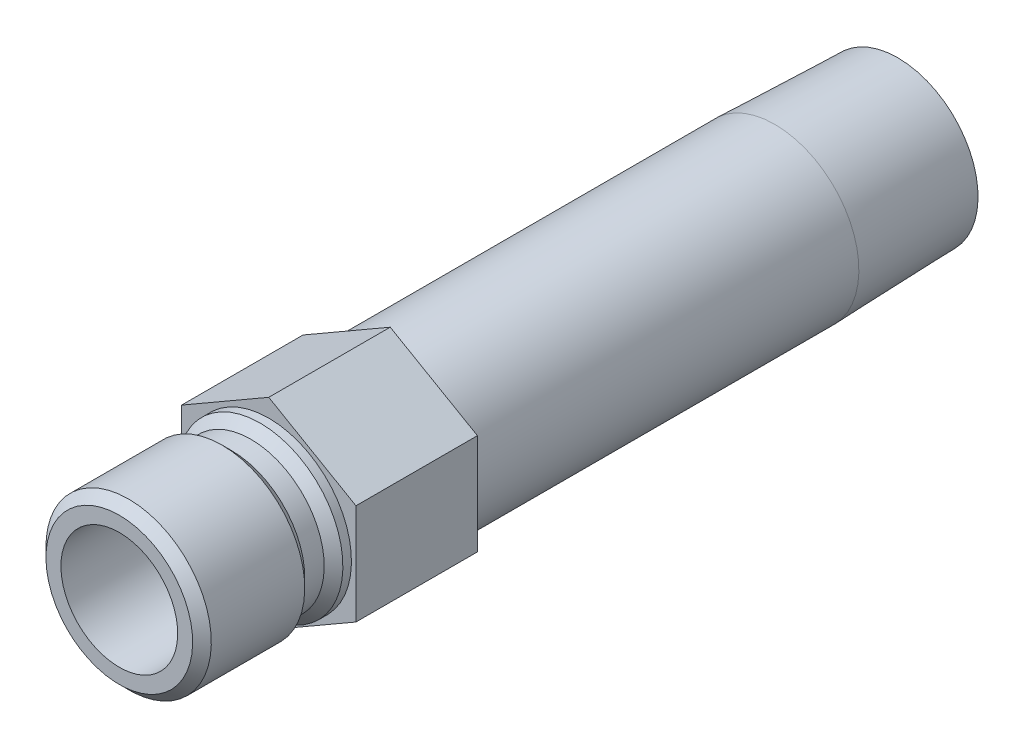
ISO-10303-21;
HEADER;
FILE_DESCRIPTION(('STEP AP214'),'2;1');
FILE_NAME('part.step','',(''),(''),'','','');
FILE_SCHEMA(('AUTOMOTIVE_DESIGN { 1 0 10303 214 1 1 1 1 }'));
ENDSEC;
DATA;
#1=APPLICATION_CONTEXT('core data for automotive mechanical design processes');
#2=APPLICATION_PROTOCOL_DEFINITION('international standard','automotive_design',2000,#1);
#3=PRODUCT_CONTEXT('',#1,'mechanical');
#4=PRODUCT('Part','Part','',(#3));
#5=PRODUCT_RELATED_PRODUCT_CATEGORY('part','',(#4));
#6=PRODUCT_DEFINITION_FORMATION('','',#4);
#7=PRODUCT_DEFINITION_CONTEXT('part definition',#1,'design');
#8=PRODUCT_DEFINITION('design','',#6,#7);
#9=PRODUCT_DEFINITION_SHAPE('','',#8);
#10=(LENGTH_UNIT() NAMED_UNIT(*) SI_UNIT(.MILLI.,.METRE.));
#11=(NAMED_UNIT(*) PLANE_ANGLE_UNIT() SI_UNIT($,.RADIAN.));
#12=(NAMED_UNIT(*) SI_UNIT($,.STERADIAN.) SOLID_ANGLE_UNIT());
#13=UNCERTAINTY_MEASURE_WITH_UNIT(LENGTH_MEASURE(1.E-05),#10,'distance_accuracy_value','');
#14=(GEOMETRIC_REPRESENTATION_CONTEXT(3) GLOBAL_UNCERTAINTY_ASSIGNED_CONTEXT((#13)) GLOBAL_UNIT_ASSIGNED_CONTEXT((#10,
#11,#12)) REPRESENTATION_CONTEXT('',''));
#15=CARTESIAN_POINT('',(0.,0.,0.));
#16=DIRECTION('',(0.,0.,1.));
#17=DIRECTION('',(1.,0.,0.));
#18=AXIS2_PLACEMENT_3D('',#15,#16,#17);
#19=CARTESIAN_POINT('',(0.,0.,0.));
#20=DIRECTION('',(0.,0.,-1.));
#21=DIRECTION('',(0.,1.,0.));
#22=AXIS2_PLACEMENT_3D('',#19,#20,#21);
#23=CYLINDRICAL_SURFACE('',#22,4.7625);
#24=CARTESIAN_POINT('',(0.,0.,0.));
#25=DIRECTION('',(0.,0.,1.));
#26=DIRECTION('',(1.,0.,0.));
#27=AXIS2_PLACEMENT_3D('',#24,#25,#26);
#28=CIRCLE('',#27,4.7625);
#29=CARTESIAN_POINT('',(4.7625,0.,0.));
#30=VERTEX_POINT('',#29);
#31=EDGE_CURVE('E138',#30,#30,#28,.T.);
#32=ORIENTED_EDGE('',*,*,#31,.F.);
#33=EDGE_LOOP('',(#32));
#34=FACE_BOUND('',#33,.T.);
#35=CARTESIAN_POINT('',(0.,0.,12.192));
#36=DIRECTION('',(0.,0.,-1.));
#37=DIRECTION('',(0.,1.,0.));
#38=AXIS2_PLACEMENT_3D('',#35,#36,#37);
#39=CIRCLE('',#38,4.7625);
#40=CARTESIAN_POINT('',(0.,4.7625,12.192));
#41=VERTEX_POINT('',#40);
#42=EDGE_CURVE('E11',#41,#41,#39,.T.);
#43=ORIENTED_EDGE('',*,*,#42,.F.);
#44=EDGE_LOOP('',(#43));
#45=FACE_BOUND('',#44,.T.);
#46=ADVANCED_FACE('F33',(#34,#45),#23,.F.);
#47=CARTESIAN_POINT('',(0.,4.7625,12.192));
#48=DIRECTION('',(0.,0.,1.));
#49=DIRECTION('',(0.,-1.,0.));
#50=AXIS2_PLACEMENT_3D('',#47,#48,#49);
#51=PLANE('',#50);
#52=ORIENTED_EDGE('',*,*,#42,.T.);
#53=EDGE_LOOP('',(#52));
#54=FACE_BOUND('',#53,.T.);
#55=CARTESIAN_POINT('',(0.,0.,12.192));
#56=DIRECTION('',(0.,0.,-1.));
#57=DIRECTION('',(0.,1.,0.));
#58=AXIS2_PLACEMENT_3D('',#55,#56,#57);
#59=CIRCLE('',#58,5.9817);
#60=CARTESIAN_POINT('',(0.,5.9817,12.192));
#61=VERTEX_POINT('',#60);
#62=EDGE_CURVE('E41',#61,#61,#59,.T.);
#63=ORIENTED_EDGE('',*,*,#62,.F.);
#64=EDGE_LOOP('',(#63));
#65=FACE_BOUND('',#64,.T.);
#66=ADVANCED_FACE('F181',(#54,#65),#51,.T.);
#67=CARTESIAN_POINT('',(0.,0.,11.43));
#68=DIRECTION('',(0.,0.,-1.));
#69=DIRECTION('',(0.,1.,0.));
#70=AXIS2_PLACEMENT_3D('',#67,#68,#69);
#71=CONICAL_SURFACE('',#70,6.7437,0.785398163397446);
#72=ORIENTED_EDGE('',*,*,#62,.T.);
#73=EDGE_LOOP('',(#72));
#74=FACE_BOUND('',#73,.T.);
#75=CARTESIAN_POINT('',(0.,0.,11.43));
#76=DIRECTION('',(0.,0.,-1.));
#77=DIRECTION('',(0.,1.,0.));
#78=AXIS2_PLACEMENT_3D('',#75,#76,#77);
#79=CIRCLE('',#78,6.7437);
#80=CARTESIAN_POINT('',(0.,6.7437,11.43));
#81=VERTEX_POINT('',#80);
#82=EDGE_CURVE('E173',#81,#81,#79,.T.);
#83=ORIENTED_EDGE('',*,*,#82,.F.);
#84=EDGE_LOOP('',(#83));
#85=FACE_BOUND('',#84,.T.);
#86=ADVANCED_FACE('F178',(#74,#85),#71,.T.);
#87=CARTESIAN_POINT('',(0.,0.,0.));
#88=DIRECTION('',(0.,0.,-1.));
#89=DIRECTION('',(0.,1.,0.));
#90=AXIS2_PLACEMENT_3D('',#87,#88,#89);
#91=CYLINDRICAL_SURFACE('',#90,6.7437);
#92=ORIENTED_EDGE('',*,*,#82,.T.);
#93=EDGE_LOOP('',(#92));
#94=FACE_BOUND('',#93,.T.);
#95=CARTESIAN_POINT('',(0.,0.,3.81));
#96=DIRECTION('',(0.,0.,-1.));
#97=DIRECTION('',(0.,1.,0.));
#98=AXIS2_PLACEMENT_3D('',#95,#96,#97);
#99=CIRCLE('',#98,6.7437);
#100=CARTESIAN_POINT('',(0.,6.7437,3.81));
#101=VERTEX_POINT('',#100);
#102=EDGE_CURVE('E170',#101,#101,#99,.T.);
#103=ORIENTED_EDGE('',*,*,#102,.F.);
#104=EDGE_LOOP('',(#103));
#105=FACE_BOUND('',#104,.T.);
#106=ADVANCED_FACE('F188',(#94,#105),#91,.T.);
#107=CARTESIAN_POINT('',(0.,0.,3.048));
#108=DIRECTION('',(0.,0.,1.));
#109=DIRECTION('',(0.,-1.,0.));
#110=AXIS2_PLACEMENT_3D('',#107,#108,#109);
#111=CONICAL_SURFACE('',#110,5.9817,0.785398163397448);
#112=ORIENTED_EDGE('',*,*,#102,.T.);
#113=EDGE_LOOP('',(#112));
#114=FACE_BOUND('',#113,.T.);
#115=CARTESIAN_POINT('',(0.,0.,3.048));
#116=DIRECTION('',(0.,0.,-1.));
#117=DIRECTION('',(0.,1.,0.));
#118=AXIS2_PLACEMENT_3D('',#115,#116,#117);
#119=CIRCLE('',#118,5.9817);
#120=CARTESIAN_POINT('',(0.,5.9817,3.048));
#121=VERTEX_POINT('',#120);
#122=EDGE_CURVE('E167',#121,#121,#119,.T.);
#123=ORIENTED_EDGE('',*,*,#122,.F.);
#124=EDGE_LOOP('',(#123));
#125=FACE_BOUND('',#124,.T.);
#126=ADVANCED_FACE('F194',(#114,#125),#111,.T.);
#127=CARTESIAN_POINT('',(0.,0.,0.));
#128=DIRECTION('',(0.,0.,-1.));
#129=DIRECTION('',(0.,1.,0.));
#130=AXIS2_PLACEMENT_3D('',#127,#128,#129);
#131=CYLINDRICAL_SURFACE('',#130,5.9817);
#132=ORIENTED_EDGE('',*,*,#122,.T.);
#133=EDGE_LOOP('',(#132));
#134=FACE_BOUND('',#133,.T.);
#135=CARTESIAN_POINT('',(0.,0.,1.4605));
#136=DIRECTION('',(0.,0.,-1.));
#137=DIRECTION('',(0.,1.,0.));
#138=AXIS2_PLACEMENT_3D('',#135,#136,#137);
#139=CIRCLE('',#138,5.9817);
#140=CARTESIAN_POINT('',(0.,5.9817,1.4605));
#141=VERTEX_POINT('',#140);
#142=EDGE_CURVE('E164',#141,#141,#139,.T.);
#143=ORIENTED_EDGE('',*,*,#142,.F.);
#144=EDGE_LOOP('',(#143));
#145=FACE_BOUND('',#144,.T.);
#146=ADVANCED_FACE('F198',(#134,#145),#131,.T.);
#147=CARTESIAN_POINT('',(0.,0.,0.698499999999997));
#148=DIRECTION('',(0.,0.,-1.));
#149=DIRECTION('',(0.,1.,0.));
#150=AXIS2_PLACEMENT_3D('',#147,#148,#149);
#151=CONICAL_SURFACE('',#150,6.7437,0.785398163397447);
#152=ORIENTED_EDGE('',*,*,#142,.T.);
#153=EDGE_LOOP('',(#152));
#154=FACE_BOUND('',#153,.T.);
#155=CARTESIAN_POINT('',(0.,0.,0.698499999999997));
#156=DIRECTION('',(0.,0.,-1.));
#157=DIRECTION('',(0.,1.,0.));
#158=AXIS2_PLACEMENT_3D('',#155,#156,#157);
#159=CIRCLE('',#158,6.7437);
#160=CARTESIAN_POINT('',(0.,6.7437,0.698499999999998));
#161=VERTEX_POINT('',#160);
#162=EDGE_CURVE('E161',#161,#161,#159,.T.);
#163=ORIENTED_EDGE('',*,*,#162,.F.);
#164=EDGE_LOOP('',(#163));
#165=FACE_BOUND('',#164,.T.);
#166=ADVANCED_FACE('F202',(#154,#165),#151,.T.);
#167=CARTESIAN_POINT('',(0.,0.,0.));
#168=DIRECTION('',(0.,0.,-1.));
#169=DIRECTION('',(0.,1.,0.));
#170=AXIS2_PLACEMENT_3D('',#167,#168,#169);
#171=CYLINDRICAL_SURFACE('',#170,6.7437);
#172=ORIENTED_EDGE('',*,*,#162,.T.);
#173=EDGE_LOOP('',(#172));
#174=FACE_BOUND('',#173,.T.);
#175=CARTESIAN_POINT('',(0.,0.,0.));
#176=DIRECTION('',(0.,0.,-1.));
#177=DIRECTION('',(0.,1.,0.));
#178=AXIS2_PLACEMENT_3D('',#175,#176,#177);
#179=CIRCLE('',#178,6.7437);
#180=CARTESIAN_POINT('',(0.,6.7437,0.));
#181=VERTEX_POINT('',#180);
#182=EDGE_CURVE('E158',#181,#181,#179,.T.);
#183=ORIENTED_EDGE('',*,*,#182,.F.);
#184=EDGE_LOOP('',(#183));
#185=FACE_BOUND('',#184,.T.);
#186=ADVANCED_FACE('F206',(#174,#185),#171,.T.);
#187=CARTESIAN_POINT('',(0.,6.7437,0.));
#188=DIRECTION('',(0.,0.,1.));
#189=DIRECTION('',(0.,-1.,0.));
#190=AXIS2_PLACEMENT_3D('',#187,#188,#189);
#191=PLANE('',#190);
#192=ORIENTED_EDGE('',*,*,#182,.T.);
#193=EDGE_LOOP('',(#192));
#194=FACE_BOUND('',#193,.T.);
#195=DIRECTION('',(-0.866025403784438,-0.5,0.));
#196=VECTOR('',#195,1.);
#197=CARTESIAN_POINT('',(0.,8.21223022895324,0.));
#198=LINE('',#197,#196);
#199=CARTESIAN_POINT('',(0.,8.21223022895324,0.));
#200=VERTEX_POINT('',#199);
#201=CARTESIAN_POINT('',(-7.112,4.10611511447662,0.));
#202=VERTEX_POINT('',#201);
#203=EDGE_CURVE('E120',#200,#202,#198,.T.);
#204=ORIENTED_EDGE('',*,*,#203,.T.);
#205=DIRECTION('',(0.,-1.,0.));
#206=VECTOR('',#205,1.);
#207=CARTESIAN_POINT('',(-7.112,4.10611511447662,0.));
#208=LINE('',#207,#206);
#209=CARTESIAN_POINT('',(-7.112,-4.10611511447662,0.));
#210=VERTEX_POINT('',#209);
#211=EDGE_CURVE('E123',#202,#210,#208,.T.);
#212=ORIENTED_EDGE('',*,*,#211,.T.);
#213=DIRECTION('',(0.866025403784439,-0.5,0.));
#214=VECTOR('',#213,1.);
#215=CARTESIAN_POINT('',(-7.112,-4.10611511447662,0.));
#216=LINE('',#215,#214);
#217=CARTESIAN_POINT('',(0.,-8.21223022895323,0.));
#218=VERTEX_POINT('',#217);
#219=EDGE_CURVE('E127',#210,#218,#216,.T.);
#220=ORIENTED_EDGE('',*,*,#219,.T.);
#221=DIRECTION('',(0.866025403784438,0.5,0.));
#222=VECTOR('',#221,1.);
#223=CARTESIAN_POINT('',(0.,-8.21223022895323,0.));
#224=LINE('',#223,#222);
#225=CARTESIAN_POINT('',(7.112,-4.10611511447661,0.));
#226=VERTEX_POINT('',#225);
#227=EDGE_CURVE('E130',#218,#226,#224,.T.);
#228=ORIENTED_EDGE('',*,*,#227,.T.);
#229=DIRECTION('',(0.,1.,0.));
#230=VECTOR('',#229,1.);
#231=CARTESIAN_POINT('',(7.112,-4.10611511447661,0.));
#232=LINE('',#231,#230);
#233=CARTESIAN_POINT('',(7.112,4.10611511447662,0.));
#234=VERTEX_POINT('',#233);
#235=EDGE_CURVE('E97',#226,#234,#232,.T.);
#236=ORIENTED_EDGE('',*,*,#235,.T.);
#237=DIRECTION('',(-0.866025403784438,0.5,0.));
#238=VECTOR('',#237,1.);
#239=CARTESIAN_POINT('',(7.112,4.10611511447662,0.));
#240=LINE('',#239,#238);
#241=EDGE_CURVE('E133',#234,#200,#240,.T.);
#242=ORIENTED_EDGE('',*,*,#241,.T.);
#243=EDGE_LOOP('',(#204,#212,#220,#228,#236,#242));
#244=FACE_BOUND('',#243,.T.);
#245=ADVANCED_FACE('F210',(#194,#244),#191,.T.);
#246=CARTESIAN_POINT('',(-7.112,4.10611511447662,0.));
#247=DIRECTION('',(0.,0.,1.));
#248=DIRECTION('',(1.,0.,0.));
#249=AXIS2_PLACEMENT_3D('',#246,#247,#248);
#250=PLANE('',#249);
#251=ORIENTED_EDGE('',*,*,#31,.T.);
#252=EDGE_LOOP('',(#251));
#253=FACE_BOUND('',#252,.T.);
#254=CARTESIAN_POINT('',(0.,0.,0.));
#255=DIRECTION('',(0.,0.,1.));
#256=DIRECTION('',(1.,0.,0.));
#257=AXIS2_PLACEMENT_3D('',#254,#255,#256);
#258=CIRCLE('',#257,4.62279999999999);
#259=CARTESIAN_POINT('',(4.62279999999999,0.,0.));
#260=VERTEX_POINT('',#259);
#261=EDGE_CURVE('E124',#260,#260,#258,.T.);
#262=ORIENTED_EDGE('',*,*,#261,.F.);
#263=EDGE_LOOP('',(#262));
#264=FACE_BOUND('',#263,.T.);
#265=ADVANCED_FACE('F214',(#253,#264),#250,.T.);
#266=CARTESIAN_POINT('',(0.,0.,-51.308));
#267=DIRECTION('',(0.,0.,1.));
#268=DIRECTION('',(0.,-1.,0.));
#269=AXIS2_PLACEMENT_3D('',#266,#267,#268);
#270=CONICAL_SURFACE('',#269,6.54447060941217,0.0312396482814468);
#271=CARTESIAN_POINT('',(0.,0.,-41.275));
#272=DIRECTION('',(0.,0.,-1.));
#273=DIRECTION('',(0.,1.,0.));
#274=AXIS2_PLACEMENT_3D('',#271,#272,#273);
#275=CIRCLE('',#274,6.85799999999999);
#276=CARTESIAN_POINT('',(0.,6.858,-41.275));
#277=VERTEX_POINT('',#276);
#278=EDGE_CURVE('E155',#277,#277,#275,.T.);
#279=ORIENTED_EDGE('',*,*,#278,.T.);
#280=EDGE_LOOP('',(#279));
#281=FACE_BOUND('',#280,.T.);
#282=CARTESIAN_POINT('',(0.,0.,-51.308));
#283=DIRECTION('',(0.,0.,-1.));
#284=DIRECTION('',(0.,1.,0.));
#285=AXIS2_PLACEMENT_3D('',#282,#283,#284);
#286=CIRCLE('',#285,6.54447060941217);
#287=CARTESIAN_POINT('',(0.,6.54447060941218,-51.308));
#288=VERTEX_POINT('',#287);
#289=EDGE_CURVE('E152',#288,#288,#286,.T.);
#290=ORIENTED_EDGE('',*,*,#289,.F.);
#291=EDGE_LOOP('',(#290));
#292=FACE_BOUND('',#291,.T.);
#293=ADVANCED_FACE('F220',(#281,#292),#270,.T.);
#294=CARTESIAN_POINT('',(0.,0.,0.));
#295=DIRECTION('',(0.,0.,-1.));
#296=DIRECTION('',(0.,1.,0.));
#297=AXIS2_PLACEMENT_3D('',#294,#295,#296);
#298=CYLINDRICAL_SURFACE('',#297,6.858);
#299=ORIENTED_EDGE('',*,*,#278,.F.);
#300=EDGE_LOOP('',(#299));
#301=FACE_BOUND('',#300,.T.);
#302=CARTESIAN_POINT('',(0.,0.,-9.906));
#303=DIRECTION('',(0.,0.,1.));
#304=DIRECTION('',(1.,0.,0.));
#305=AXIS2_PLACEMENT_3D('',#302,#303,#304);
#306=CIRCLE('',#305,6.858);
#307=CARTESIAN_POINT('',(6.858,0.,-9.906));
#308=VERTEX_POINT('',#307);
#309=EDGE_CURVE('E146',#308,#308,#306,.F.);
#310=ORIENTED_EDGE('',*,*,#309,.T.);
#311=EDGE_LOOP('',(#310));
#312=FACE_BOUND('',#311,.T.);
#313=ADVANCED_FACE('F216',(#301,#312),#298,.T.);
#314=CARTESIAN_POINT('',(0.,6.54447060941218,-51.308));
#315=DIRECTION('',(0.,0.,-1.));
#316=DIRECTION('',(0.,1.,0.));
#317=AXIS2_PLACEMENT_3D('',#314,#315,#316);
#318=PLANE('',#317);
#319=ORIENTED_EDGE('',*,*,#289,.T.);
#320=EDGE_LOOP('',(#319));
#321=FACE_BOUND('',#320,.T.);
#322=CARTESIAN_POINT('',(0.,0.,-51.308));
#323=DIRECTION('',(0.,0.,-1.));
#324=DIRECTION('',(0.,1.,0.));
#325=AXIS2_PLACEMENT_3D('',#322,#323,#324);
#326=CIRCLE('',#325,4.62279999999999);
#327=CARTESIAN_POINT('',(0.,4.6228,-51.308));
#328=VERTEX_POINT('',#327);
#329=EDGE_CURVE('E149',#328,#328,#326,.T.);
#330=ORIENTED_EDGE('',*,*,#329,.F.);
#331=EDGE_LOOP('',(#330));
#332=FACE_BOUND('',#331,.T.);
#333=ADVANCED_FACE('F219',(#321,#332),#318,.T.);
#334=CARTESIAN_POINT('',(0.,0.,0.));
#335=DIRECTION('',(0.,0.,-1.));
#336=DIRECTION('',(0.,1.,0.));
#337=AXIS2_PLACEMENT_3D('',#334,#335,#336);
#338=CYLINDRICAL_SURFACE('',#337,4.62279999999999);
#339=ORIENTED_EDGE('',*,*,#261,.T.);
#340=EDGE_LOOP('',(#339));
#341=FACE_BOUND('',#340,.T.);
#342=ORIENTED_EDGE('',*,*,#329,.T.);
#343=EDGE_LOOP('',(#342));
#344=FACE_BOUND('',#343,.T.);
#345=ADVANCED_FACE('F227',(#341,#344),#338,.F.);
#346=CARTESIAN_POINT('',(0.,8.21223022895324,-9.906));
#347=DIRECTION('',(-0.5,0.866025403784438,0.));
#348=DIRECTION('',(-0.866025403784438,-0.5,0.));
#349=AXIS2_PLACEMENT_3D('',#346,#347,#348);
#350=PLANE('',#349);
#351=ORIENTED_EDGE('',*,*,#203,.F.);
#352=DIRECTION('',(0.,0.,1.));
#353=VECTOR('',#352,1.);
#354=CARTESIAN_POINT('',(0.,8.21223022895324,-9.906));
#355=LINE('',#354,#353);
#356=CARTESIAN_POINT('',(0.,8.21223022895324,-9.906));
#357=VERTEX_POINT('',#356);
#358=EDGE_CURVE('E49',#357,#200,#355,.T.);
#359=ORIENTED_EDGE('',*,*,#358,.F.);
#360=DIRECTION('',(-0.866025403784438,-0.5,0.));
#361=VECTOR('',#360,1.);
#362=CARTESIAN_POINT('',(0.,8.21223022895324,-9.906));
#363=LINE('',#362,#361);
#364=CARTESIAN_POINT('',(-7.112,4.10611511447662,-9.906));
#365=VERTEX_POINT('',#364);
#366=EDGE_CURVE('E136',#357,#365,#363,.T.);
#367=ORIENTED_EDGE('',*,*,#366,.T.);
#368=DIRECTION('',(0.,0.,1.));
#369=VECTOR('',#368,1.);
#370=CARTESIAN_POINT('',(-7.112,4.10611511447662,-9.906));
#371=LINE('',#370,#369);
#372=EDGE_CURVE('E84',#365,#202,#371,.T.);
#373=ORIENTED_EDGE('',*,*,#372,.T.);
#374=EDGE_LOOP('',(#351,#359,#367,#373));
#375=FACE_BOUND('',#374,.T.);
#376=ADVANCED_FACE('F231',(#375),#350,.T.);
#377=CARTESIAN_POINT('',(7.112,4.10611511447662,-9.906));
#378=DIRECTION('',(0.5,0.866025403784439,0.));
#379=DIRECTION('',(-0.866025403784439,0.5,0.));
#380=AXIS2_PLACEMENT_3D('',#377,#378,#379);
#381=PLANE('',#380);
#382=ORIENTED_EDGE('',*,*,#241,.F.);
#383=DIRECTION('',(0.,0.,1.));
#384=VECTOR('',#383,1.);
#385=CARTESIAN_POINT('',(7.112,4.10611511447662,-9.906));
#386=LINE('',#385,#384);
#387=CARTESIAN_POINT('',(7.112,4.10611511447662,-9.906));
#388=VERTEX_POINT('',#387);
#389=EDGE_CURVE('E72',#388,#234,#386,.T.);
#390=ORIENTED_EDGE('',*,*,#389,.F.);
#391=DIRECTION('',(-0.866025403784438,0.5,0.));
#392=VECTOR('',#391,1.);
#393=CARTESIAN_POINT('',(7.112,4.10611511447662,-9.906));
#394=LINE('',#393,#392);
#395=EDGE_CURVE('E110',#388,#357,#394,.T.);
#396=ORIENTED_EDGE('',*,*,#395,.T.);
#397=ORIENTED_EDGE('',*,*,#358,.T.);
#398=EDGE_LOOP('',(#382,#390,#396,#397));
#399=FACE_BOUND('',#398,.T.);
#400=ADVANCED_FACE('F235',(#399),#381,.T.);
#401=CARTESIAN_POINT('',(7.112,-4.10611511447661,-9.906));
#402=DIRECTION('',(1.,0.,0.));
#403=DIRECTION('',(0.,1.,0.));
#404=AXIS2_PLACEMENT_3D('',#401,#402,#403);
#405=PLANE('',#404);
#406=ORIENTED_EDGE('',*,*,#235,.F.);
#407=DIRECTION('',(0.,0.,1.));
#408=VECTOR('',#407,1.);
#409=CARTESIAN_POINT('',(7.112,-4.10611511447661,-9.906));
#410=LINE('',#409,#408);
#411=CARTESIAN_POINT('',(7.112,-4.10611511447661,-9.906));
#412=VERTEX_POINT('',#411);
#413=EDGE_CURVE('E92',#412,#226,#410,.T.);
#414=ORIENTED_EDGE('',*,*,#413,.F.);
#415=DIRECTION('',(0.,1.,0.));
#416=VECTOR('',#415,1.);
#417=CARTESIAN_POINT('',(7.112,-4.10611511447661,-9.906));
#418=LINE('',#417,#416);
#419=EDGE_CURVE('E95',#412,#388,#418,.T.);
#420=ORIENTED_EDGE('',*,*,#419,.T.);
#421=ORIENTED_EDGE('',*,*,#389,.T.);
#422=EDGE_LOOP('',(#406,#414,#420,#421));
#423=FACE_BOUND('',#422,.T.);
#424=ADVANCED_FACE('F94',(#423),#405,.T.);
#425=CARTESIAN_POINT('',(0.,-8.21223022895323,-9.906));
#426=DIRECTION('',(0.5,-0.866025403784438,0.));
#427=DIRECTION('',(0.866025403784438,0.5,0.));
#428=AXIS2_PLACEMENT_3D('',#425,#426,#427);
#429=PLANE('',#428);
#430=ORIENTED_EDGE('',*,*,#227,.F.);
#431=DIRECTION('',(0.,0.,1.));
#432=VECTOR('',#431,1.);
#433=CARTESIAN_POINT('',(0.,-8.21223022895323,-9.906));
#434=LINE('',#433,#432);
#435=CARTESIAN_POINT('',(0.,-8.21223022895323,-9.906));
#436=VERTEX_POINT('',#435);
#437=EDGE_CURVE('E102',#436,#218,#434,.T.);
#438=ORIENTED_EDGE('',*,*,#437,.F.);
#439=DIRECTION('',(0.866025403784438,0.5,0.));
#440=VECTOR('',#439,1.);
#441=CARTESIAN_POINT('',(0.,-8.21223022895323,-9.906));
#442=LINE('',#441,#440);
#443=EDGE_CURVE('E108',#436,#412,#442,.T.);
#444=ORIENTED_EDGE('',*,*,#443,.T.);
#445=ORIENTED_EDGE('',*,*,#413,.T.);
#446=EDGE_LOOP('',(#430,#438,#444,#445));
#447=FACE_BOUND('',#446,.T.);
#448=ADVANCED_FACE('F112',(#447),#429,.T.);
#449=CARTESIAN_POINT('',(-7.112,-4.10611511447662,-9.906));
#450=DIRECTION('',(-0.5,-0.866025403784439,0.));
#451=DIRECTION('',(0.866025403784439,-0.5,0.));
#452=AXIS2_PLACEMENT_3D('',#449,#450,#451);
#453=PLANE('',#452);
#454=ORIENTED_EDGE('',*,*,#219,.F.);
#455=DIRECTION('',(0.,0.,1.));
#456=VECTOR('',#455,1.);
#457=CARTESIAN_POINT('',(-7.112,-4.10611511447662,-9.906));
#458=LINE('',#457,#456);
#459=CARTESIAN_POINT('',(-7.112,-4.10611511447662,-9.906));
#460=VERTEX_POINT('',#459);
#461=EDGE_CURVE('E141',#460,#210,#458,.T.);
#462=ORIENTED_EDGE('',*,*,#461,.F.);
#463=DIRECTION('',(0.866025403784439,-0.5,0.));
#464=VECTOR('',#463,1.);
#465=CARTESIAN_POINT('',(-7.112,-4.10611511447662,-9.906));
#466=LINE('',#465,#464);
#467=EDGE_CURVE('E113',#460,#436,#466,.T.);
#468=ORIENTED_EDGE('',*,*,#467,.T.);
#469=ORIENTED_EDGE('',*,*,#437,.T.);
#470=EDGE_LOOP('',(#454,#462,#468,#469));
#471=FACE_BOUND('',#470,.T.);
#472=ADVANCED_FACE('F239',(#471),#453,.T.);
#473=CARTESIAN_POINT('',(-7.112,4.10611511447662,-9.906));
#474=DIRECTION('',(-1.,0.,0.));
#475=DIRECTION('',(0.,-1.,0.));
#476=AXIS2_PLACEMENT_3D('',#473,#474,#475);
#477=PLANE('',#476);
#478=ORIENTED_EDGE('',*,*,#211,.F.);
#479=ORIENTED_EDGE('',*,*,#372,.F.);
#480=DIRECTION('',(0.,-1.,0.));
#481=VECTOR('',#480,1.);
#482=CARTESIAN_POINT('',(-7.112,4.10611511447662,-9.906));
#483=LINE('',#482,#481);
#484=EDGE_CURVE('E115',#365,#460,#483,.T.);
#485=ORIENTED_EDGE('',*,*,#484,.T.);
#486=ORIENTED_EDGE('',*,*,#461,.T.);
#487=EDGE_LOOP('',(#478,#479,#485,#486));
#488=FACE_BOUND('',#487,.T.);
#489=ADVANCED_FACE('F236',(#488),#477,.T.);
#490=CARTESIAN_POINT('',(-7.112,4.10611511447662,-9.906));
#491=DIRECTION('',(0.,0.,1.));
#492=DIRECTION('',(1.,0.,0.));
#493=AXIS2_PLACEMENT_3D('',#490,#491,#492);
#494=PLANE('',#493);
#495=ORIENTED_EDGE('',*,*,#309,.F.);
#496=EDGE_LOOP('',(#495));
#497=FACE_BOUND('',#496,.T.);
#498=ORIENTED_EDGE('',*,*,#366,.F.);
#499=ORIENTED_EDGE('',*,*,#395,.F.);
#500=ORIENTED_EDGE('',*,*,#419,.F.);
#501=ORIENTED_EDGE('',*,*,#443,.F.);
#502=ORIENTED_EDGE('',*,*,#467,.F.);
#503=ORIENTED_EDGE('',*,*,#484,.F.);
#504=EDGE_LOOP('',(#498,#499,#500,#501,#502,#503));
#505=FACE_BOUND('',#504,.T.);
#506=ADVANCED_FACE('F106',(#497,#505),#494,.F.);
#507=CLOSED_SHELL('',(#46,#66,#86,#106,#126,#146,#166,#186,#245,#265,#293,#313,#333,#345,#376,
#400,#424,#448,#472,#489,#506));
#508=MANIFOLD_SOLID_BREP('B2',#507);
#509=ADVANCED_BREP_SHAPE_REPRESENTATION('',(#18,#508),#14);
#510=SHAPE_DEFINITION_REPRESENTATION(#9,#509);
ENDSEC;
END-ISO-10303-21;
